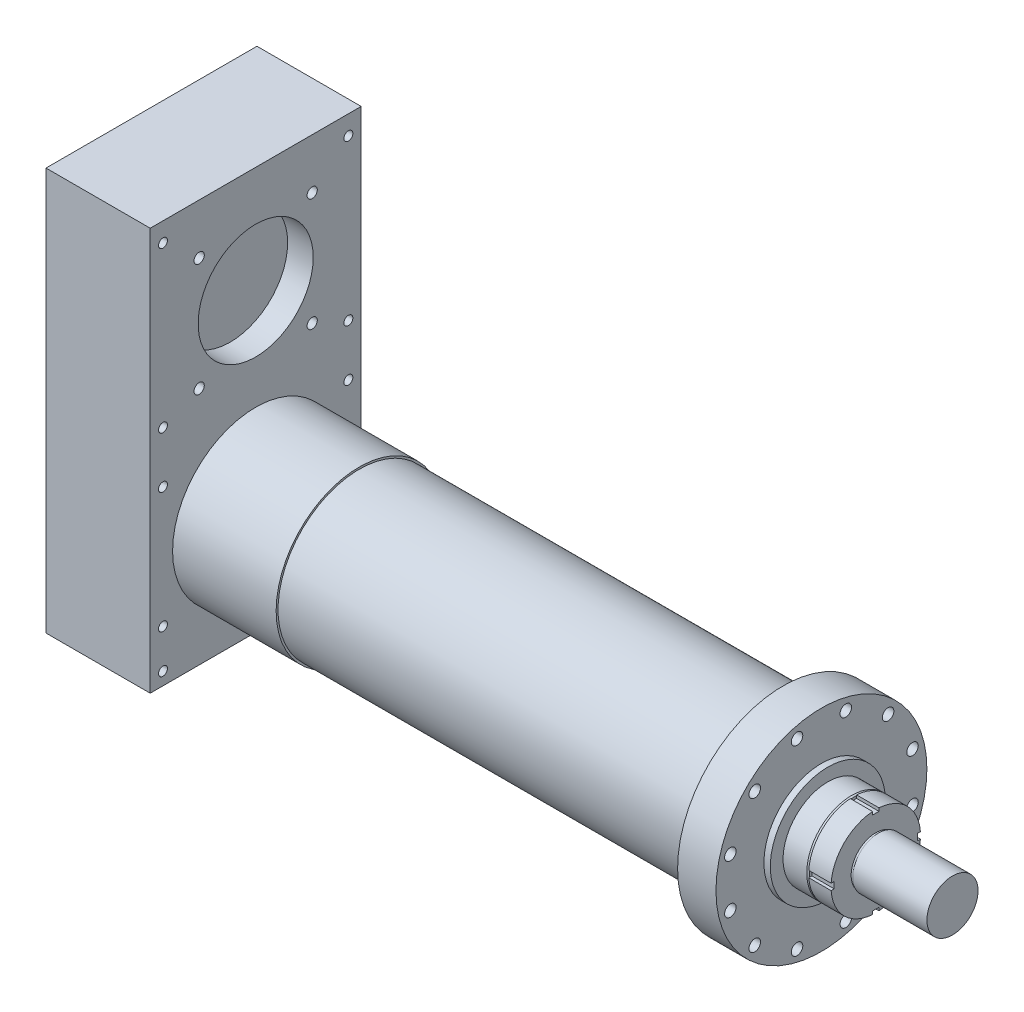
from build123d import *

# Parameters (mm, degrees)
SKETCH_1_R          = 127
SKETCH_1_R_2        = 110
EXTRUDE_1_DEPTH     = 663
SKETCH_2_R          = 165
EXTRUDE_2_DEPTH     = 60
SKETCH_3_R          = 90
EXTRUDE_3_DEPTH     = 10
SKETCH_4_R          = 9
CUT_EXTRUDE_1_DEPTH = 60
SKETCH_5_R          = 70
EXTRUDE_4_DEPTH     = 40
CHAMFER_1_SIZE      = 3
CHAMFER_1_SIZE2     = 1.091910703
SKETCH_7_R          = 70
EXTRUDE_5_DEPTH     = 35
SKETCH_8_R          = 38.5
EXTRUDE_6_DEPTH     = 4
SKETCH_9_R          = 40
EXTRUDE_7_DEPTH     = 116
SKETCH_10_W         = 10
SKETCH_10_H         = 12.219318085
SKETCH_10_W_2       = 33.965202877
SKETCH_10_H_2       = 10
SKETCH_10_H_3       = 35.687535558
CUT_EXTRUDE_2_DEPTH = 35
SKETCH_11_R         = 130
EXTRUDE_8_DEPTH     = 162
SKETCH_12_W         = 330
SKETCH_12_H         = 630
EXTRUDE_9_DEPTH     = 163
SKETCH_14_R         = 90
SKETCH_14_R_2       = 8
SKETCH_14_R_3       = 7
CUT_EXTRUDE_3_DEPTH = 40


with BuildPart() as part:
    # Sketch 1 → Extrude 1 (new body)
    with BuildSketch(Plane(origin=(0, 0, 0), x_dir=(0, 0, -1), z_dir=(1, 0, 0))):
        Circle(SKETCH_1_R)
        Circle(SKETCH_1_R_2, mode=Mode.SUBTRACT)
    extrude(amount=EXTRUDE_1_DEPTH)


with BuildPart() as body_2:
    # Sketch 2 → Extrude 2 (new body)
    with BuildSketch(Plane(origin=(663, 0, 0), x_dir=(0, 0, -1), z_dir=(1, 0, 0))):
        Circle(SKETCH_2_R)
    extrude(amount=EXTRUDE_2_DEPTH)

    # Sketch 3 → Extrude 3 (add)
    with BuildSketch(Plane(origin=(723, 0, 0), x_dir=(0, 0, -1), z_dir=(1, 0, 0))):
        Circle(SKETCH_3_R)
    extrude(amount=EXTRUDE_3_DEPTH)

    # Sketch 4 → Cut-Extrude 1 (cut)
    with BuildSketch(Plane(origin=(723, 0, 0), x_dir=(0, 0, -1), z_dir=(1, 0, 0))):
        with Locations((38.175809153, 142.474059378)):
            Circle(SKETCH_4_R)
        with Locations((104.298250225, 104.298250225)):
            Circle(SKETCH_4_R)
        with Locations((142.474059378, 38.175809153)):
            Circle(SKETCH_4_R)
        with Locations((142.474059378, -38.175809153)):
            Circle(SKETCH_4_R)
        with Locations((104.298250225, -104.298250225)):
            Circle(SKETCH_4_R)
        with Locations((38.175809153, -142.474059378)):
            Circle(SKETCH_4_R)
        with Locations((-38.175809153, -142.474059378)):
            Circle(SKETCH_4_R)
        with Locations((-104.298250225, -104.298250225)):
            Circle(SKETCH_4_R)
        with Locations((-142.474059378, -38.175809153)):
            Circle(SKETCH_4_R)
        with Locations((-142.474059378, 38.175809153)):
            Circle(SKETCH_4_R)
        with Locations((-104.298250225, 104.298250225)):
            Circle(SKETCH_4_R)
        with Locations((-38.175809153, 142.474059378)):
            Circle(SKETCH_4_R)
    extrude(amount=-CUT_EXTRUDE_1_DEPTH, mode=Mode.SUBTRACT)

    # Sketch 5 → Extrude 4 (add)
    with BuildSketch(Plane(origin=(733, 0, 0), x_dir=(0, 0, -1), z_dir=(1, 0, 0))):
        Circle(SKETCH_5_R)
    extrude(amount=EXTRUDE_4_DEPTH)

    # Chamfer 1
    chamfer_1_edges = [body_2.edges().sort_by_distance(p)[0] for p in [
        (773, 0, 70),
    ]]
    chamfer_1_side = [body_2.faces().sort_by_distance(p)[0] for p in [
        (753, 0, 70),
    ]]
    chamfer(chamfer_1_edges, length=CHAMFER_1_SIZE, length2=CHAMFER_1_SIZE2, reference=chamfer_1_side[0])

    # Sketch 7 → Extrude 5 (add)
    with BuildSketch(Plane(origin=(773, 0, 0), x_dir=(0, 0, -1), z_dir=(1, 0, 0))):
        Circle(SKETCH_7_R)
    extrude(amount=EXTRUDE_5_DEPTH)

    # Sketch 8 → Extrude 6 (add)
    with BuildSketch(Plane(origin=(808, 0, 0), x_dir=(0, 0, -1), z_dir=(1, 0, 0))):
        Circle(SKETCH_8_R)
    extrude(amount=EXTRUDE_6_DEPTH)

    # Sketch 9 → Extrude 7 (add)
    with BuildSketch(Plane(origin=(812, 0, 0), x_dir=(0, 0, -1), z_dir=(1, 0, 0))):
        with Locations(Location((0, 0, 0), (0, 0, 180))):
            Circle(SKETCH_9_R)
    extrude(amount=EXTRUDE_7_DEPTH)

    # Sketch 10 → Cut-Extrude 2 (cut)
    with BuildSketch(Plane(origin=(808, 0, 0), x_dir=(0, 0, -1), z_dir=(1, 0, 0))):
        with Locations((0, -71.109659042)):
            Rectangle(SKETCH_10_W, SKETCH_10_H)
        Polygon((-76.465931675, 5), (-65, 5), (-65, -5), (-79.460488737, -5), align=None)
        with Locations((81.982601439, 0)):
            Rectangle(SKETCH_10_W_2, SKETCH_10_H_2)
        with Locations((0, 82.843767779)):
            Rectangle(SKETCH_10_W, SKETCH_10_H_3)
    extrude(amount=-CUT_EXTRUDE_2_DEPTH, mode=Mode.SUBTRACT)


with BuildPart() as body_3:
    # Sketch 11 → Extrude 8 (new body)
    with BuildSketch(Plane.ZY):
        Circle(SKETCH_11_R)
    extrude(amount=EXTRUDE_8_DEPTH)


with BuildPart() as body_4:
    # Sketch 12 → Extrude 9 (new body)
    with BuildSketch(Plane.ZY.offset(162)):
        with Locations((0, 140)):
            Rectangle(SKETCH_12_W, SKETCH_12_H)
    extrude(amount=EXTRUDE_9_DEPTH)

    # Sketch 14 → Cut-Extrude 3 (cut)
    with BuildSketch(Plane(origin=(-162, 0, 0), x_dir=(0, 0, -1), z_dir=(1, 0, 0))):
        with Locations((0, 288)):
            Circle(SKETCH_14_R)
        with Locations((-88.388347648, 376.388347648)):
            Circle(SKETCH_14_R_2)
        with Locations((88.388347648, 376.388347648)):
            Circle(SKETCH_14_R_2)
        with Locations((88.388347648, 199.611652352)):
            Circle(SKETCH_14_R_2)
        with Locations((-88.388347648, 199.611652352)):
            Circle(SKETCH_14_R_2)
        with Locations((-145, 175)):
            Circle(SKETCH_14_R_3)
        with Locations((-145, 94.5)):
            Circle(SKETCH_14_R_3)
        with Locations((-145, -94.5)):
            Circle(SKETCH_14_R_3)
        with Locations((-145, -155)):
            Circle(SKETCH_14_R_3)
        with Locations((-145, 425)):
            Circle(SKETCH_14_R_3)
        with Locations(Location((145, -155, 0), (0, 0, 180))):
            Circle(SKETCH_14_R_3)
        with Locations(Location((145, -94.5, 0), (0, 0, 180))):
            Circle(SKETCH_14_R_3)
        with Locations(Location((145, 94.5, 0), (0, 0, 180))):
            Circle(SKETCH_14_R_3)
        with Locations(Location((145, 175, 0), (0, 0, 180))):
            Circle(SKETCH_14_R_3)
        with Locations(Location((145, 425, 0), (0, 0, 180))):
            Circle(SKETCH_14_R_3)
    extrude(amount=-CUT_EXTRUDE_3_DEPTH, mode=Mode.SUBTRACT)


solid = Compound([part.part, body_2.part, body_3.part, body_4.part])
